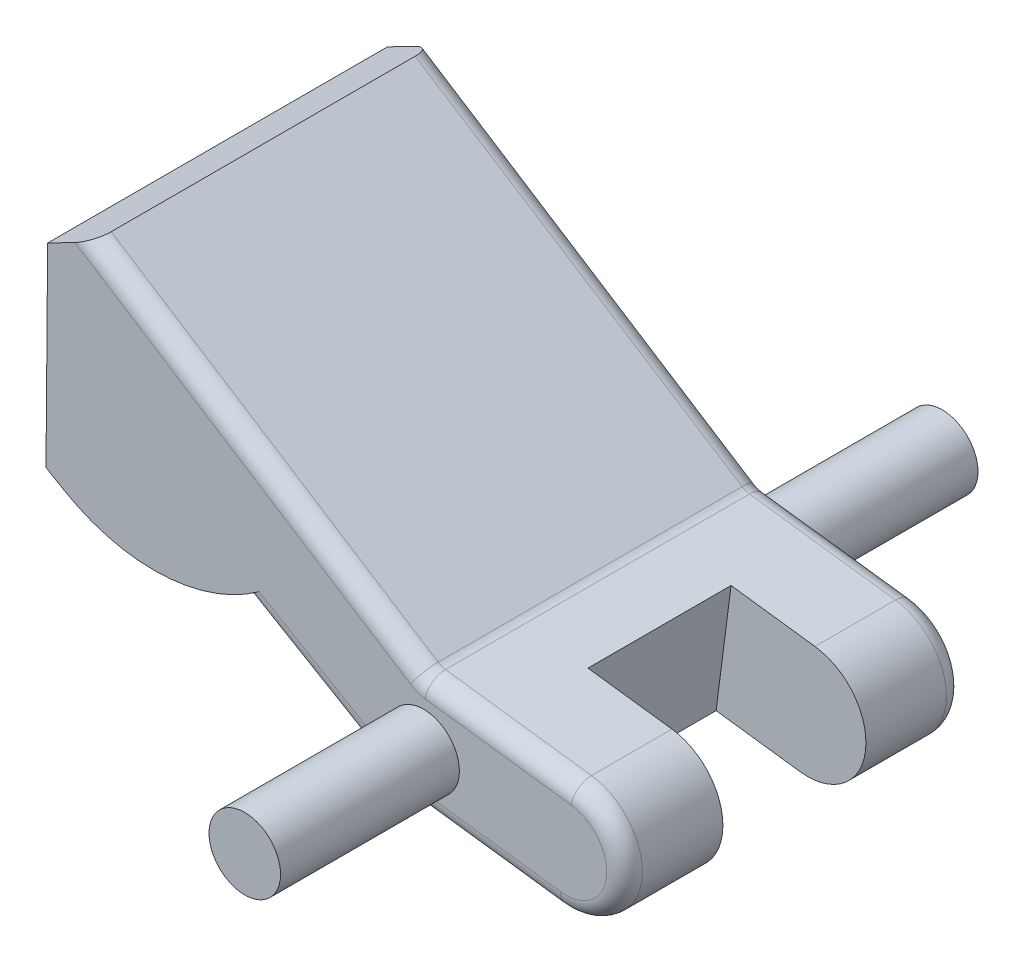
ISO-10303-21;
HEADER;
FILE_DESCRIPTION(('STEP AP214'),'2;1');
FILE_NAME('part.step','',(''),(''),'','','');
FILE_SCHEMA(('AUTOMOTIVE_DESIGN { 1 0 10303 214 1 1 1 1 }'));
ENDSEC;
DATA;
#1=APPLICATION_CONTEXT('core data for automotive mechanical design processes');
#2=APPLICATION_PROTOCOL_DEFINITION('international standard','automotive_design',2000,#1);
#3=PRODUCT_CONTEXT('',#1,'mechanical');
#4=PRODUCT('Part','Part','',(#3));
#5=PRODUCT_RELATED_PRODUCT_CATEGORY('part','',(#4));
#6=PRODUCT_DEFINITION_FORMATION('','',#4);
#7=PRODUCT_DEFINITION_CONTEXT('part definition',#1,'design');
#8=PRODUCT_DEFINITION('design','',#6,#7);
#9=PRODUCT_DEFINITION_SHAPE('','',#8);
#10=(LENGTH_UNIT() NAMED_UNIT(*) SI_UNIT(.MILLI.,.METRE.));
#11=(NAMED_UNIT(*) PLANE_ANGLE_UNIT() SI_UNIT($,.RADIAN.));
#12=(NAMED_UNIT(*) SI_UNIT($,.STERADIAN.) SOLID_ANGLE_UNIT());
#13=UNCERTAINTY_MEASURE_WITH_UNIT(LENGTH_MEASURE(1.E-05),#10,'distance_accuracy_value','');
#14=(GEOMETRIC_REPRESENTATION_CONTEXT(3) GLOBAL_UNCERTAINTY_ASSIGNED_CONTEXT((#13)) GLOBAL_UNIT_ASSIGNED_CONTEXT((#10,
#11,#12)) REPRESENTATION_CONTEXT('',''));
#15=CARTESIAN_POINT('',(0.,0.,0.));
#16=DIRECTION('',(0.,0.,1.));
#17=DIRECTION('',(1.,0.,0.));
#18=AXIS2_PLACEMENT_3D('',#15,#16,#17);
#19=CARTESIAN_POINT('',(7.96819424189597,-0.760739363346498,9.5));
#20=DIRECTION('',(0.,0.,-1.));
#21=DIRECTION('',(-1.,0.,0.));
#22=AXIS2_PLACEMENT_3D('',#19,#20,#21);
#23=CYLINDRICAL_SURFACE('',#22,3.26616509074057);
#24=DIRECTION('',(0.,0.,-1.));
#25=VECTOR('',#24,1.);
#26=CARTESIAN_POINT('',(8.38655404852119,2.478521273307,9.5));
#27=LINE('',#26,#25);
#28=CARTESIAN_POINT('',(8.38655404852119,2.478521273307,-4.));
#29=VERTEX_POINT('',#28);
#30=CARTESIAN_POINT('',(8.38655404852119,2.478521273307,-8.5));
#31=VERTEX_POINT('',#30);
#32=EDGE_CURVE('E294',#29,#31,#27,.T.);
#33=ORIENTED_EDGE('',*,*,#32,.F.);
#34=CARTESIAN_POINT('',(7.96819424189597,-0.760739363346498,-4.));
#35=DIRECTION('',(0.,0.,-1.));
#36=DIRECTION('',(-1.,0.,0.));
#37=AXIS2_PLACEMENT_3D('',#34,#35,#36);
#38=CIRCLE('',#37,3.26616509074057);
#39=CARTESIAN_POINT('',(7.54983443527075,-4.,-4.));
#40=VERTEX_POINT('',#39);
#41=EDGE_CURVE('E557',#29,#40,#38,.T.);
#42=ORIENTED_EDGE('',*,*,#41,.T.);
#43=DIRECTION('',(0.,0.,-1.));
#44=VECTOR('',#43,1.);
#45=CARTESIAN_POINT('',(7.54983443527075,-4.,9.5));
#46=LINE('',#45,#44);
#47=CARTESIAN_POINT('',(7.54983443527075,-4.,-8.5));
#48=VERTEX_POINT('',#47);
#49=EDGE_CURVE('E301',#40,#48,#46,.T.);
#50=ORIENTED_EDGE('',*,*,#49,.T.);
#51=CARTESIAN_POINT('',(7.96819424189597,-0.760739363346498,-8.5));
#52=DIRECTION('',(0.,0.,-1.));
#53=DIRECTION('',(-1.,0.,0.));
#54=AXIS2_PLACEMENT_3D('',#51,#52,#53);
#55=CIRCLE('',#54,3.26616509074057);
#56=EDGE_CURVE('E384',#48,#31,#55,.F.);
#57=ORIENTED_EDGE('',*,*,#56,.T.);
#58=EDGE_LOOP('',(#33,#42,#50,#57));
#59=FACE_BOUND('',#58,.T.);
#60=ADVANCED_FACE('F35',(#59),#23,.T.);
#61=CARTESIAN_POINT('',(-12.6758758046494,-1.82268279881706,9.5));
#62=DIRECTION('',(0.507196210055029,0.861830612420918,0.));
#63=DIRECTION('',(-0.861830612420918,0.507196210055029,0.));
#64=AXIS2_PLACEMENT_3D('',#61,#62,#63);
#65=PLANE('',#64);
#66=DIRECTION('',(0.861830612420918,-0.507196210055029,0.));
#67=VECTOR('',#66,1.);
#68=CARTESIAN_POINT('',(-27.1720806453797,6.70848336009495,5.));
#69=LINE('',#68,#67);
#70=CARTESIAN_POINT('',(-21.1154168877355,3.14407423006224,5.));
#71=VERTEX_POINT('',#70);
#72=CARTESIAN_POINT('',(-20.1395478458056,2.56976522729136,5.));
#73=VERTEX_POINT('',#72);
#74=EDGE_CURVE('E255',#71,#73,#69,.T.);
#75=ORIENTED_EDGE('',*,*,#74,.T.);
#76=DIRECTION('',(0.,0.,-1.));
#77=VECTOR('',#76,1.);
#78=CARTESIAN_POINT('',(-20.1395478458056,2.56976522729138,9.5));
#79=LINE('',#78,#77);
#80=CARTESIAN_POINT('',(-20.1395478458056,2.56976522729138,9.5));
#81=VERTEX_POINT('',#80);
#82=EDGE_CURVE('E327',#73,#81,#79,.F.);
#83=ORIENTED_EDGE('',*,*,#82,.T.);
#84=DIRECTION('',(0.861830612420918,-0.507196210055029,0.));
#85=VECTOR('',#84,1.);
#86=CARTESIAN_POINT('',(-12.6758758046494,-1.82268279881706,9.5));
#87=LINE('',#86,#85);
#88=CARTESIAN_POINT('',(-21.1154168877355,3.14407423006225,9.5));
#89=VERTEX_POINT('',#88);
#90=EDGE_CURVE('E290',#89,#81,#87,.T.);
#91=ORIENTED_EDGE('',*,*,#90,.F.);
#92=DIRECTION('',(0.,0.,-1.));
#93=VECTOR('',#92,1.);
#94=CARTESIAN_POINT('',(-21.1154168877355,3.14407423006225,9.5));
#95=LINE('',#94,#93);
#96=EDGE_CURVE('E315',#89,#71,#95,.T.);
#97=ORIENTED_EDGE('',*,*,#96,.T.);
#98=EDGE_LOOP('',(#75,#83,#91,#97));
#99=FACE_BOUND('',#98,.T.);
#100=ADVANCED_FACE('F444',(#99),#65,.F.);
#101=CARTESIAN_POINT('',(0.,3.56166879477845,9.5));
#102=DIRECTION('',(-0.128088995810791,-0.99176267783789,0.));
#103=DIRECTION('',(0.99176267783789,-0.128088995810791,0.));
#104=AXIS2_PLACEMENT_3D('',#101,#102,#103);
#105=PLANE('',#104);
#106=DIRECTION('',(0.,0.,1.));
#107=VECTOR('',#106,1.);
#108=CARTESIAN_POINT('',(3.69171326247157,3.08487343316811,4.));
#109=LINE('',#108,#107);
#110=CARTESIAN_POINT('',(3.69171326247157,3.08487343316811,-4.));
#111=VERTEX_POINT('',#110);
#112=CARTESIAN_POINT('',(3.69171326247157,3.08487343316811,4.));
#113=VERTEX_POINT('',#112);
#114=EDGE_CURVE('E229',#111,#113,#109,.T.);
#115=ORIENTED_EDGE('',*,*,#114,.F.);
#116=DIRECTION('',(-0.99176267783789,0.128088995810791,0.));
#117=VECTOR('',#116,1.);
#118=CARTESIAN_POINT('',(3.69171326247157,3.08487343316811,-4.));
#119=LINE('',#118,#117);
#120=EDGE_CURVE('E225',#29,#111,#119,.T.);
#121=ORIENTED_EDGE('',*,*,#120,.F.);
#122=ORIENTED_EDGE('',*,*,#32,.T.);
#123=DIRECTION('',(-0.99176267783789,0.128088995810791,0.));
#124=VECTOR('',#123,1.);
#125=CARTESIAN_POINT('',(0.,3.56166879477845,-8.5));
#126=LINE('',#125,#124);
#127=CARTESIAN_POINT('',(0.222201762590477,3.53297079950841,-8.5));
#128=VERTEX_POINT('',#127);
#129=EDGE_CURVE('E391',#31,#128,#126,.T.);
#130=ORIENTED_EDGE('',*,*,#129,.T.);
#131=DIRECTION('',(0.,0.,-1.));
#132=VECTOR('',#131,1.);
#133=CARTESIAN_POINT('',(0.222201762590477,3.53297079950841,9.5));
#134=LINE('',#133,#132);
#135=CARTESIAN_POINT('',(0.222201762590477,3.53297079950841,8.5));
#136=VERTEX_POINT('',#135);
#137=EDGE_CURVE('E389',#128,#136,#134,.F.);
#138=ORIENTED_EDGE('',*,*,#137,.T.);
#139=DIRECTION('',(-0.99176267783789,0.128088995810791,0.));
#140=VECTOR('',#139,1.);
#141=CARTESIAN_POINT('',(0.,3.56166879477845,8.5));
#142=LINE('',#141,#140);
#143=CARTESIAN_POINT('',(8.38655404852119,2.478521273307,8.5));
#144=VERTEX_POINT('',#143);
#145=EDGE_CURVE('E393',#136,#144,#142,.F.);
#146=ORIENTED_EDGE('',*,*,#145,.T.);
#147=CARTESIAN_POINT('',(8.38655404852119,2.478521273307,4.));
#148=VERTEX_POINT('',#147);
#149=EDGE_CURVE('E238',#144,#148,#27,.T.);
#150=ORIENTED_EDGE('',*,*,#149,.T.);
#151=DIRECTION('',(0.99176267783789,-0.128088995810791,0.));
#152=VECTOR('',#151,1.);
#153=CARTESIAN_POINT('',(3.69171326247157,3.08487343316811,4.));
#154=LINE('',#153,#152);
#155=EDGE_CURVE('E218',#113,#148,#154,.T.);
#156=ORIENTED_EDGE('',*,*,#155,.F.);
#157=EDGE_LOOP('',(#115,#121,#122,#130,#138,#146,#150,#156));
#158=FACE_BOUND('',#157,.T.);
#159=ADVANCED_FACE('F236',(#158),#105,.F.);
#160=CARTESIAN_POINT('',(0.,3.56166879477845,9.5));
#161=DIRECTION('',(-0.539006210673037,-0.842301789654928,0.));
#162=DIRECTION('',(0.842301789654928,-0.539006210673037,0.));
#163=AXIS2_PLACEMENT_3D('',#160,#161,#162);
#164=PLANE('',#163);
#165=DIRECTION('',(-0.842301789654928,0.539006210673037,0.));
#166=VECTOR('',#165,1.);
#167=CARTESIAN_POINT('',(-21.,17.,-8.5));
#168=LINE('',#167,#166);
#169=CARTESIAN_POINT('',(-0.188715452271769,3.68243168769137,-8.5));
#170=VERTEX_POINT('',#169);
#171=CARTESIAN_POINT('',(-18.4730946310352,15.3829813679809,-8.5));
#172=VERTEX_POINT('',#171);
#173=EDGE_CURVE('E395',#170,#172,#168,.T.);
#174=ORIENTED_EDGE('',*,*,#173,.T.);
#175=DIRECTION('',(0.,0.,1.));
#176=VECTOR('',#175,1.);
#177=CARTESIAN_POINT('',(-18.4730946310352,15.3829813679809,9.5));
#178=LINE('',#177,#176);
#179=CARTESIAN_POINT('',(-18.4730946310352,15.3829813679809,8.5));
#180=VERTEX_POINT('',#179);
#181=EDGE_CURVE('E58',#172,#180,#178,.T.);
#182=ORIENTED_EDGE('',*,*,#181,.T.);
#183=DIRECTION('',(-0.842301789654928,0.539006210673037,0.));
#184=VECTOR('',#183,1.);
#185=CARTESIAN_POINT('',(0.,3.56166879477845,8.5));
#186=LINE('',#185,#184);
#187=CARTESIAN_POINT('',(-0.188715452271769,3.68243168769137,8.5));
#188=VERTEX_POINT('',#187);
#189=EDGE_CURVE('E399',#180,#188,#186,.F.);
#190=ORIENTED_EDGE('',*,*,#189,.T.);
#191=DIRECTION('',(0.,0.,-1.));
#192=VECTOR('',#191,1.);
#193=CARTESIAN_POINT('',(-0.188715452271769,3.68243168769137,-9.5));
#194=LINE('',#193,#192);
#195=EDGE_CURVE('E397',#188,#170,#194,.T.);
#196=ORIENTED_EDGE('',*,*,#195,.T.);
#197=EDGE_LOOP('',(#174,#182,#190,#196));
#198=FACE_BOUND('',#197,.T.);
#199=ADVANCED_FACE('F577',(#198),#164,.F.);
#200=CARTESIAN_POINT('',(-21.1154168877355,3.14407423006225,9.5));
#201=DIRECTION('',(0.99996530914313,-0.00832949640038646,0.));
#202=DIRECTION('',(0.00832949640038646,0.99996530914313,0.));
#203=AXIS2_PLACEMENT_3D('',#200,#201,#202);
#204=PLANE('',#203);
#205=DIRECTION('',(-0.00832949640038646,-0.99996530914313,0.));
#206=VECTOR('',#205,1.);
#207=CARTESIAN_POINT('',(-21.1154168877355,3.14407423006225,9.5));
#208=LINE('',#207,#206);
#209=CARTESIAN_POINT('',(-21.0244781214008,14.0613742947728,9.5));
#210=VERTEX_POINT('',#209);
#211=EDGE_CURVE('E288',#210,#89,#208,.T.);
#212=ORIENTED_EDGE('',*,*,#211,.F.);
#213=DIRECTION('',(0.,0.,-1.));
#214=VECTOR('',#213,1.);
#215=CARTESIAN_POINT('',(-21.0244781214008,14.0613742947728,9.5));
#216=LINE('',#215,#214);
#217=CARTESIAN_POINT('',(-21.0244781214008,14.0613742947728,-9.5));
#218=VERTEX_POINT('',#217);
#219=EDGE_CURVE('E559',#210,#218,#216,.T.);
#220=ORIENTED_EDGE('',*,*,#219,.T.);
#221=DIRECTION('',(-0.00832949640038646,-0.99996530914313,0.));
#222=VECTOR('',#221,1.);
#223=CARTESIAN_POINT('',(-21.1154168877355,3.14407423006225,-9.5));
#224=LINE('',#223,#222);
#225=CARTESIAN_POINT('',(-21.1154168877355,3.14407423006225,-9.5));
#226=VERTEX_POINT('',#225);
#227=EDGE_CURVE('E295',#218,#226,#224,.T.);
#228=ORIENTED_EDGE('',*,*,#227,.T.);
#229=CARTESIAN_POINT('',(-21.1154168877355,3.14407423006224,-5.));
#230=VERTEX_POINT('',#229);
#231=EDGE_CURVE('E314',#230,#226,#95,.T.);
#232=ORIENTED_EDGE('',*,*,#231,.F.);
#233=DIRECTION('',(0.00832949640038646,0.99996530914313,0.));
#234=VECTOR('',#233,1.);
#235=CARTESIAN_POINT('',(-21.1154168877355,3.14407423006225,-5.));
#236=LINE('',#235,#234);
#237=CARTESIAN_POINT('',(-21.0673265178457,8.91737663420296,-5.));
#238=VERTEX_POINT('',#237);
#239=EDGE_CURVE('E259',#230,#238,#236,.T.);
#240=ORIENTED_EDGE('',*,*,#239,.T.);
#241=DIRECTION('',(0.,0.,1.));
#242=VECTOR('',#241,1.);
#243=CARTESIAN_POINT('',(-21.0673265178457,8.91737663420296,9.5));
#244=LINE('',#243,#242);
#245=CARTESIAN_POINT('',(-21.0673265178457,8.91737663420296,5.));
#246=VERTEX_POINT('',#245);
#247=EDGE_CURVE('E270',#238,#246,#244,.T.);
#248=ORIENTED_EDGE('',*,*,#247,.T.);
#249=DIRECTION('',(-0.00832949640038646,-0.99996530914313,0.));
#250=VECTOR('',#249,1.);
#251=CARTESIAN_POINT('',(-21.1154168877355,3.14407423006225,5.));
#252=LINE('',#251,#250);
#253=EDGE_CURVE('E273',#246,#71,#252,.T.);
#254=ORIENTED_EDGE('',*,*,#253,.T.);
#255=ORIENTED_EDGE('',*,*,#96,.F.);
#256=EDGE_LOOP('',(#212,#220,#228,#232,#240,#248,#254,#255));
#257=FACE_BOUND('',#256,.T.);
#258=ADVANCED_FACE('F517',(#257),#204,.F.);
#259=DIRECTION('',(0.861830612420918,-0.507196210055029,0.));
#260=VECTOR('',#259,1.);
#261=CARTESIAN_POINT('',(-12.6758758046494,-1.82268279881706,-9.5));
#262=LINE('',#261,#260);
#263=CARTESIAN_POINT('',(-20.1395478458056,2.56976522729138,-9.5));
#264=VERTEX_POINT('',#263);
#265=EDGE_CURVE('E291',#226,#264,#262,.T.);
#266=ORIENTED_EDGE('',*,*,#265,.T.);
#267=DIRECTION('',(0.,0.,-1.));
#268=VECTOR('',#267,1.);
#269=CARTESIAN_POINT('',(-20.1395478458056,2.56976522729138,9.5));
#270=LINE('',#269,#268);
#271=CARTESIAN_POINT('',(-20.1395478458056,2.56976522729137,-5.));
#272=VERTEX_POINT('',#271);
#273=EDGE_CURVE('E321',#264,#272,#270,.F.);
#274=ORIENTED_EDGE('',*,*,#273,.T.);
#275=DIRECTION('',(0.861830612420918,-0.507196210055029,0.));
#276=VECTOR('',#275,1.);
#277=CARTESIAN_POINT('',(-27.1720806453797,6.70848336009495,-5.));
#278=LINE('',#277,#276);
#279=EDGE_CURVE('E263',#230,#272,#278,.T.);
#280=ORIENTED_EDGE('',*,*,#279,.F.);
#281=ORIENTED_EDGE('',*,*,#231,.T.);
#282=EDGE_LOOP('',(#266,#274,#280,#281));
#283=FACE_BOUND('',#282,.T.);
#284=ADVANCED_FACE('F453',(#283),#65,.F.);
#285=CARTESIAN_POINT('',(-1.52158863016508,-2.58549183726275,9.5));
#286=DIRECTION('',(0.507196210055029,0.861830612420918,0.));
#287=DIRECTION('',(-0.861830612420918,0.507196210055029,0.));
#288=AXIS2_PLACEMENT_3D('',#285,#286,#287);
#289=PLANE('',#288);
#290=CARTESIAN_POINT('',(-15.5435726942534,5.66659050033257,0.));
#291=DIRECTION('',(0.507196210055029,0.861830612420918,0.));
#292=DIRECTION('',(-0.861830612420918,0.507196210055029,0.));
#293=AXIS2_PLACEMENT_3D('',#290,#291,#292);
#294=CIRCLE('',#293,4.302);
#295=CARTESIAN_POINT('',(-19.2511679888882,7.8485485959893,0.));
#296=VERTEX_POINT('',#295);
#297=EDGE_CURVE('E334',#296,#296,#294,.T.);
#298=ORIENTED_EDGE('',*,*,#297,.T.);
#299=EDGE_LOOP('',(#298));
#300=FACE_BOUND('',#299,.T.);
#301=DIRECTION('',(0.,0.,-1.));
#302=VECTOR('',#301,1.);
#303=CARTESIAN_POINT('',(-1.52158863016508,-2.58549183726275,9.5));
#304=LINE('',#303,#302);
#305=CARTESIAN_POINT('',(-1.52158863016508,-2.58549183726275,8.5));
#306=VERTEX_POINT('',#305);
#307=CARTESIAN_POINT('',(-1.52158863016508,-2.58549183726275,-8.5));
#308=VERTEX_POINT('',#307);
#309=EDGE_CURVE('E308',#306,#308,#304,.T.);
#310=ORIENTED_EDGE('',*,*,#309,.F.);
#311=DIRECTION('',(0.861830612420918,-0.507196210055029,0.));
#312=VECTOR('',#311,1.);
#313=CARTESIAN_POINT('',(-1.52158863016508,-2.58549183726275,8.5));
#314=LINE('',#313,#312);
#315=CARTESIAN_POINT('',(-10.1398947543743,2.48647026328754,8.5));
#316=VERTEX_POINT('',#315);
#317=EDGE_CURVE('E359',#306,#316,#314,.F.);
#318=ORIENTED_EDGE('',*,*,#317,.T.);
#319=DIRECTION('',(0.,0.,-1.));
#320=VECTOR('',#319,1.);
#321=CARTESIAN_POINT('',(-10.1398947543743,2.48647026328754,9.5));
#322=LINE('',#321,#320);
#323=CARTESIAN_POINT('',(-10.1398947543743,2.48647026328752,5.));
#324=VERTEX_POINT('',#323);
#325=EDGE_CURVE('E312',#316,#324,#322,.T.);
#326=ORIENTED_EDGE('',*,*,#325,.T.);
#327=DIRECTION('',(0.861830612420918,-0.507196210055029,0.));
#328=VECTOR('',#327,1.);
#329=CARTESIAN_POINT('',(-24.6360995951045,11.0176364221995,5.));
#330=LINE('',#329,#328);
#331=EDGE_CURVE('E256',#246,#324,#330,.T.);
#332=ORIENTED_EDGE('',*,*,#331,.F.);
#333=ORIENTED_EDGE('',*,*,#247,.F.);
#334=DIRECTION('',(0.861830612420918,-0.507196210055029,0.));
#335=VECTOR('',#334,1.);
#336=CARTESIAN_POINT('',(-24.6360995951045,11.0176364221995,-5.));
#337=LINE('',#336,#335);
#338=CARTESIAN_POINT('',(-10.1398947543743,2.48647026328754,-5.));
#339=VERTEX_POINT('',#338);
#340=EDGE_CURVE('E260',#238,#339,#337,.T.);
#341=ORIENTED_EDGE('',*,*,#340,.T.);
#342=CARTESIAN_POINT('',(-10.1398947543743,2.48647026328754,-8.5));
#343=VERTEX_POINT('',#342);
#344=EDGE_CURVE('E311',#339,#343,#322,.T.);
#345=ORIENTED_EDGE('',*,*,#344,.T.);
#346=DIRECTION('',(0.861830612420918,-0.507196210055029,0.));
#347=VECTOR('',#346,1.);
#348=CARTESIAN_POINT('',(-1.52158863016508,-2.58549183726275,-8.5));
#349=LINE('',#348,#347);
#350=EDGE_CURVE('E357',#343,#308,#349,.T.);
#351=ORIENTED_EDGE('',*,*,#350,.T.);
#352=EDGE_LOOP('',(#310,#318,#326,#332,#333,#341,#345,#351));
#353=FACE_BOUND('',#352,.T.);
#354=ADVANCED_FACE('F502',(#300,#353),#289,.F.);
#355=CARTESIAN_POINT('',(0.,0.,9.5));
#356=DIRECTION('',(0.,0.,-1.));
#357=DIRECTION('',(-1.,0.,0.));
#358=AXIS2_PLACEMENT_3D('',#355,#356,#357);
#359=CYLINDRICAL_SURFACE('',#358,3.);
#360=DIRECTION('',(0.,0.,-1.));
#361=VECTOR('',#360,1.);
#362=CARTESIAN_POINT('',(-0.384266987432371,-2.97528803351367,9.5));
#363=LINE('',#362,#361);
#364=CARTESIAN_POINT('',(-0.384266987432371,-2.97528803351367,8.5));
#365=VERTEX_POINT('',#364);
#366=CARTESIAN_POINT('',(-0.384266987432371,-2.97528803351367,-8.5));
#367=VERTEX_POINT('',#366);
#368=EDGE_CURVE('E305',#365,#367,#363,.T.);
#369=ORIENTED_EDGE('',*,*,#368,.F.);
#370=CARTESIAN_POINT('',(0.,0.,8.5));
#371=DIRECTION('',(0.,0.,-1.));
#372=DIRECTION('',(-1.,0.,0.));
#373=AXIS2_PLACEMENT_3D('',#370,#371,#372);
#374=CIRCLE('',#373,3.);
#375=EDGE_CURVE('E377',#365,#306,#374,.T.);
#376=ORIENTED_EDGE('',*,*,#375,.T.);
#377=ORIENTED_EDGE('',*,*,#309,.T.);
#378=CARTESIAN_POINT('',(0.,0.,-8.5));
#379=DIRECTION('',(0.,0.,-1.));
#380=DIRECTION('',(-1.,0.,0.));
#381=AXIS2_PLACEMENT_3D('',#378,#379,#380);
#382=CIRCLE('',#381,3.);
#383=EDGE_CURVE('E375',#308,#367,#382,.F.);
#384=ORIENTED_EDGE('',*,*,#383,.T.);
#385=EDGE_LOOP('',(#369,#376,#377,#384));
#386=FACE_BOUND('',#385,.T.);
#387=ADVANCED_FACE('F468',(#386),#359,.T.);
#388=CARTESIAN_POINT('',(-0.384266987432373,-2.97528803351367,9.5));
#389=DIRECTION('',(0.128088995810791,0.99176267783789,0.));
#390=DIRECTION('',(-0.99176267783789,0.128088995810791,0.));
#391=AXIS2_PLACEMENT_3D('',#388,#389,#390);
#392=PLANE('',#391);
#393=ORIENTED_EDGE('',*,*,#49,.F.);
#394=DIRECTION('',(0.99176267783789,-0.128088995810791,0.));
#395=VECTOR('',#394,1.);
#396=CARTESIAN_POINT('',(2.85499364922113,-3.39364784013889,-4.));
#397=LINE('',#396,#395);
#398=CARTESIAN_POINT('',(2.85499364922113,-3.39364784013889,-4.));
#399=VERTEX_POINT('',#398);
#400=EDGE_CURVE('E243',#399,#40,#397,.T.);
#401=ORIENTED_EDGE('',*,*,#400,.F.);
#402=DIRECTION('',(0.,0.,-1.));
#403=VECTOR('',#402,1.);
#404=CARTESIAN_POINT('',(2.85499364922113,-3.39364784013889,4.));
#405=LINE('',#404,#403);
#406=CARTESIAN_POINT('',(2.85499364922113,-3.39364784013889,4.));
#407=VERTEX_POINT('',#406);
#408=EDGE_CURVE('E247',#407,#399,#405,.T.);
#409=ORIENTED_EDGE('',*,*,#408,.F.);
#410=DIRECTION('',(-0.99176267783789,0.128088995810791,0.));
#411=VECTOR('',#410,1.);
#412=CARTESIAN_POINT('',(2.85499364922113,-3.39364784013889,4.));
#413=LINE('',#412,#411);
#414=CARTESIAN_POINT('',(7.54983443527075,-4.,4.));
#415=VERTEX_POINT('',#414);
#416=EDGE_CURVE('E221',#415,#407,#413,.T.);
#417=ORIENTED_EDGE('',*,*,#416,.F.);
#418=CARTESIAN_POINT('',(7.54983443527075,-4.,8.5));
#419=VERTEX_POINT('',#418);
#420=EDGE_CURVE('E302',#419,#415,#46,.T.);
#421=ORIENTED_EDGE('',*,*,#420,.F.);
#422=DIRECTION('',(0.99176267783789,-0.128088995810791,0.));
#423=VECTOR('',#422,1.);
#424=CARTESIAN_POINT('',(-0.384266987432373,-2.97528803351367,8.5));
#425=LINE('',#424,#423);
#426=EDGE_CURVE('E382',#419,#365,#425,.F.);
#427=ORIENTED_EDGE('',*,*,#426,.T.);
#428=ORIENTED_EDGE('',*,*,#368,.T.);
#429=DIRECTION('',(0.99176267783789,-0.128088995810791,0.));
#430=VECTOR('',#429,1.);
#431=CARTESIAN_POINT('',(7.54983443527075,-4.,-8.5));
#432=LINE('',#431,#430);
#433=EDGE_CURVE('E379',#367,#48,#432,.T.);
#434=ORIENTED_EDGE('',*,*,#433,.T.);
#435=EDGE_LOOP('',(#393,#401,#409,#417,#421,#427,#428,#434));
#436=FACE_BOUND('',#435,.T.);
#437=ADVANCED_FACE('F459',(#436),#392,.F.);
#438=ORIENTED_EDGE('',*,*,#420,.T.);
#439=CARTESIAN_POINT('',(7.96819424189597,-0.760739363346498,4.));
#440=DIRECTION('',(0.,0.,1.));
#441=DIRECTION('',(1.,0.,0.));
#442=AXIS2_PLACEMENT_3D('',#439,#440,#441);
#443=CIRCLE('',#442,3.26616509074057);
#444=EDGE_CURVE('E471',#415,#148,#443,.T.);
#445=ORIENTED_EDGE('',*,*,#444,.T.);
#446=ORIENTED_EDGE('',*,*,#149,.F.);
#447=CARTESIAN_POINT('',(7.96819424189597,-0.760739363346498,8.5));
#448=DIRECTION('',(0.,0.,-1.));
#449=DIRECTION('',(-1.,0.,0.));
#450=AXIS2_PLACEMENT_3D('',#447,#448,#449);
#451=CIRCLE('',#450,3.26616509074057);
#452=EDGE_CURVE('E387',#144,#419,#451,.T.);
#453=ORIENTED_EDGE('',*,*,#452,.T.);
#454=EDGE_LOOP('',(#438,#445,#446,#453));
#455=FACE_BOUND('',#454,.T.);
#456=ADVANCED_FACE('F447',(#455),#23,.T.);
#457=CARTESIAN_POINT('',(7.96819424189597,-0.760739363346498,9.5));
#458=DIRECTION('',(0.,0.,-1.));
#459=DIRECTION('',(-1.,0.,0.));
#460=AXIS2_PLACEMENT_3D('',#457,#458,#459);
#461=PLANE('',#460);
#462=DIRECTION('',(-0.842301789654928,0.539006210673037,0.));
#463=VECTOR('',#462,1.);
#464=CARTESIAN_POINT('',(7.0766057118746,-2.15401943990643,9.5));
#465=LINE('',#464,#463);
#466=CARTESIAN_POINT('',(-0.727721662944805,2.84012989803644,9.5));
#467=VERTEX_POINT('',#466);
#468=CARTESIAN_POINT('',(-19.4984040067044,14.8518749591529,9.5));
#469=VERTEX_POINT('',#468);
#470=EDGE_CURVE('E343',#467,#469,#465,.T.);
#471=ORIENTED_EDGE('',*,*,#470,.T.);
#472=DIRECTION('',(0.887943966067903,0.459951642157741,0.));
#473=VECTOR('',#472,1.);
#474=CARTESIAN_POINT('',(-21.0244781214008,14.0613742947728,9.5));
#475=LINE('',#474,#473);
#476=EDGE_CURVE('E11',#469,#210,#475,.F.);
#477=ORIENTED_EDGE('',*,*,#476,.T.);
#478=ORIENTED_EDGE('',*,*,#211,.T.);
#479=ORIENTED_EDGE('',*,*,#90,.T.);
#480=CARTESIAN_POINT('',(-15.0675857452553,11.1880713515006,9.5));
#481=DIRECTION('',(0.,0.,-1.));
#482=DIRECTION('',(-1.,0.,0.));
#483=AXIS2_PLACEMENT_3D('',#480,#481,#482);
#484=CIRCLE('',#483,10.);
#485=CARTESIAN_POINT('',(-9.19756255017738,3.0922188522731,9.5));
#486=VERTEX_POINT('',#485);
#487=EDGE_CURVE('E329',#81,#486,#484,.F.);
#488=ORIENTED_EDGE('',*,*,#487,.T.);
#489=DIRECTION('',(0.861830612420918,-0.507196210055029,0.));
#490=VECTOR('',#489,1.);
#491=CARTESIAN_POINT('',(5.23653210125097,-5.40239481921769,9.5));
#492=LINE('',#491,#490);
#493=CARTESIAN_POINT('',(-1.01439242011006,-1.72366122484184,9.5));
#494=VERTEX_POINT('',#493);
#495=EDGE_CURVE('E354',#486,#494,#492,.T.);
#496=ORIENTED_EDGE('',*,*,#495,.T.);
#497=CARTESIAN_POINT('',(0.,0.,9.5));
#498=DIRECTION('',(0.,0.,-1.));
#499=DIRECTION('',(-1.,0.,0.));
#500=AXIS2_PLACEMENT_3D('',#497,#498,#499);
#501=CIRCLE('',#500,2.);
#502=CARTESIAN_POINT('',(-0.256177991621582,-1.98352535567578,9.5));
#503=VERTEX_POINT('',#502);
#504=EDGE_CURVE('E287',#503,#494,#501,.F.);
#505=ORIENTED_EDGE('',*,*,#504,.F.);
#506=DIRECTION('',(0.99176267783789,-0.128088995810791,0.));
#507=VECTOR('',#506,1.);
#508=CARTESIAN_POINT('',(7.67792343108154,-3.00823732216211,9.5));
#509=LINE('',#508,#507);
#510=CARTESIAN_POINT('',(7.67792343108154,-3.00823732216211,9.5));
#511=VERTEX_POINT('',#510);
#512=EDGE_CURVE('E352',#503,#511,#509,.T.);
#513=ORIENTED_EDGE('',*,*,#512,.T.);
#514=CARTESIAN_POINT('',(7.96819424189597,-0.760739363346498,9.5));
#515=DIRECTION('',(0.,0.,-1.));
#516=DIRECTION('',(-1.,0.,0.));
#517=AXIS2_PLACEMENT_3D('',#514,#515,#516);
#518=CIRCLE('',#517,2.26616509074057);
#519=CARTESIAN_POINT('',(8.2584650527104,1.48675859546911,9.5));
#520=VERTEX_POINT('',#519);
#521=EDGE_CURVE('E350',#511,#520,#518,.F.);
#522=ORIENTED_EDGE('',*,*,#521,.T.);
#523=DIRECTION('',(-0.99176267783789,0.128088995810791,0.));
#524=VECTOR('',#523,1.);
#525=CARTESIAN_POINT('',(8.2584650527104,1.48675859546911,9.5));
#526=LINE('',#525,#524);
#527=CARTESIAN_POINT('',(0.0941127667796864,2.54120812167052,9.5));
#528=VERTEX_POINT('',#527);
#529=EDGE_CURVE('E348',#520,#528,#526,.T.);
#530=ORIENTED_EDGE('',*,*,#529,.T.);
#531=CARTESIAN_POINT('',(0.350290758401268,4.5247334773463,9.5));
#532=DIRECTION('',(0.,0.,-1.));
#533=DIRECTION('',(-1.,0.,0.));
#534=AXIS2_PLACEMENT_3D('',#531,#532,#533);
#535=CIRCLE('',#534,2.);
#536=EDGE_CURVE('E345',#467,#528,#535,.F.);
#537=ORIENTED_EDGE('',*,*,#536,.F.);
#538=EDGE_LOOP('',(#471,#477,#478,#479,#488,#496,#505,#513,#522,#530,#537));
#539=FACE_BOUND('',#538,.T.);
#540=ADVANCED_FACE('F458',(#539),#461,.F.);
#541=CARTESIAN_POINT('',(7.96819424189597,-0.760739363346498,-9.5));
#542=DIRECTION('',(0.,0.,-1.));
#543=DIRECTION('',(-1.,0.,0.));
#544=AXIS2_PLACEMENT_3D('',#541,#542,#543);
#545=PLANE('',#544);
#546=ORIENTED_EDGE('',*,*,#227,.F.);
#547=DIRECTION('',(-0.887943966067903,-0.459951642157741,0.));
#548=VECTOR('',#547,1.);
#549=CARTESIAN_POINT('',(-4.21888392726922,22.7666090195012,-9.5));
#550=LINE('',#549,#548);
#551=CARTESIAN_POINT('',(-19.4984040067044,14.8518749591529,-9.5));
#552=VERTEX_POINT('',#551);
#553=EDGE_CURVE('E562',#218,#552,#550,.F.);
#554=ORIENTED_EDGE('',*,*,#553,.T.);
#555=DIRECTION('',(-0.842301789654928,0.539006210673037,0.));
#556=VECTOR('',#555,1.);
#557=CARTESIAN_POINT('',(-0.539006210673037,2.71936700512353,-9.5));
#558=LINE('',#557,#556);
#559=CARTESIAN_POINT('',(-0.727721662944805,2.84012989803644,-9.5));
#560=VERTEX_POINT('',#559);
#561=EDGE_CURVE('E364',#552,#560,#558,.F.);
#562=ORIENTED_EDGE('',*,*,#561,.T.);
#563=CARTESIAN_POINT('',(0.350290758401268,4.5247334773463,-9.5));
#564=DIRECTION('',(0.,0.,-1.));
#565=DIRECTION('',(-1.,0.,0.));
#566=AXIS2_PLACEMENT_3D('',#563,#564,#565);
#567=CIRCLE('',#566,2.);
#568=CARTESIAN_POINT('',(0.0941127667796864,2.54120812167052,-9.5));
#569=VERTEX_POINT('',#568);
#570=EDGE_CURVE('E361',#569,#560,#567,.T.);
#571=ORIENTED_EDGE('',*,*,#570,.F.);
#572=DIRECTION('',(-0.99176267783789,0.128088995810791,0.));
#573=VECTOR('',#572,1.);
#574=CARTESIAN_POINT('',(8.2584650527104,1.48675859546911,-9.5));
#575=LINE('',#574,#573);
#576=CARTESIAN_POINT('',(8.2584650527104,1.48675859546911,-9.5));
#577=VERTEX_POINT('',#576);
#578=EDGE_CURVE('E366',#569,#577,#575,.F.);
#579=ORIENTED_EDGE('',*,*,#578,.T.);
#580=CARTESIAN_POINT('',(7.96819424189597,-0.760739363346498,-9.5));
#581=DIRECTION('',(0.,0.,-1.));
#582=DIRECTION('',(-1.,0.,0.));
#583=AXIS2_PLACEMENT_3D('',#580,#581,#582);
#584=CIRCLE('',#583,2.26616509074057);
#585=CARTESIAN_POINT('',(7.67792343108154,-3.00823732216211,-9.5));
#586=VERTEX_POINT('',#585);
#587=EDGE_CURVE('E368',#577,#586,#584,.T.);
#588=ORIENTED_EDGE('',*,*,#587,.T.);
#589=DIRECTION('',(0.99176267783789,-0.128088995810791,0.));
#590=VECTOR('',#589,1.);
#591=CARTESIAN_POINT('',(-0.256177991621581,-1.98352535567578,-9.5));
#592=LINE('',#591,#590);
#593=CARTESIAN_POINT('',(-0.256177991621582,-1.98352535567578,-9.5));
#594=VERTEX_POINT('',#593);
#595=EDGE_CURVE('E370',#586,#594,#592,.F.);
#596=ORIENTED_EDGE('',*,*,#595,.T.);
#597=CARTESIAN_POINT('',(0.,0.,-9.5));
#598=DIRECTION('',(0.,0.,-1.));
#599=DIRECTION('',(-1.,0.,0.));
#600=AXIS2_PLACEMENT_3D('',#597,#598,#599);
#601=CIRCLE('',#600,2.);
#602=CARTESIAN_POINT('',(-1.01439242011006,-1.72366122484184,-9.5));
#603=VERTEX_POINT('',#602);
#604=EDGE_CURVE('E280',#594,#603,#601,.F.);
#605=ORIENTED_EDGE('',*,*,#604,.T.);
#606=DIRECTION('',(0.861830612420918,-0.507196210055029,0.));
#607=VECTOR('',#606,1.);
#608=CARTESIAN_POINT('',(-9.63269854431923,3.34830087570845,-9.5));
#609=LINE('',#608,#607);
#610=CARTESIAN_POINT('',(-9.19756255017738,3.0922188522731,-9.5));
#611=VERTEX_POINT('',#610);
#612=EDGE_CURVE('E372',#603,#611,#609,.F.);
#613=ORIENTED_EDGE('',*,*,#612,.T.);
#614=CARTESIAN_POINT('',(-15.0675857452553,11.1880713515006,-9.5));
#615=DIRECTION('',(0.,0.,-1.));
#616=DIRECTION('',(-1.,0.,0.));
#617=AXIS2_PLACEMENT_3D('',#614,#615,#616);
#618=CIRCLE('',#617,10.);
#619=EDGE_CURVE('E286',#611,#264,#618,.T.);
#620=ORIENTED_EDGE('',*,*,#619,.T.);
#621=ORIENTED_EDGE('',*,*,#265,.F.);
#622=EDGE_LOOP('',(#546,#554,#562,#571,#579,#588,#596,#605,#613,#620,#621));
#623=FACE_BOUND('',#622,.T.);
#624=ADVANCED_FACE('F465',(#623),#545,.T.);
#625=CARTESIAN_POINT('',(0.,0.,-19.5));
#626=DIRECTION('',(0.,0.,1.));
#627=DIRECTION('',(1.,0.,0.));
#628=AXIS2_PLACEMENT_3D('',#625,#626,#627);
#629=PLANE('',#628);
#630=CARTESIAN_POINT('',(0.,0.,-19.5));
#631=DIRECTION('',(0.,0.,1.));
#632=DIRECTION('',(1.,0.,0.));
#633=AXIS2_PLACEMENT_3D('',#630,#631,#632);
#634=CIRCLE('',#633,2.);
#635=CARTESIAN_POINT('',(2.,0.,-19.5));
#636=VERTEX_POINT('',#635);
#637=EDGE_CURVE('E276',#636,#636,#634,.T.);
#638=ORIENTED_EDGE('',*,*,#637,.F.);
#639=EDGE_LOOP('',(#638));
#640=FACE_BOUND('',#639,.T.);
#641=ADVANCED_FACE('F598',(#640),#629,.F.);
#642=CARTESIAN_POINT('',(0.,0.,19.5));
#643=DIRECTION('',(0.,0.,-1.));
#644=DIRECTION('',(-1.,0.,0.));
#645=AXIS2_PLACEMENT_3D('',#642,#643,#644);
#646=CYLINDRICAL_SURFACE('',#645,2.);
#647=EDGE_CURVE('E297',#603,#594,#601,.F.);
#648=ORIENTED_EDGE('',*,*,#647,.F.);
#649=ORIENTED_EDGE('',*,*,#604,.F.);
#650=EDGE_LOOP('',(#648,#649));
#651=FACE_BOUND('',#650,.T.);
#652=ORIENTED_EDGE('',*,*,#637,.T.);
#653=EDGE_LOOP('',(#652));
#654=FACE_BOUND('',#653,.T.);
#655=ADVANCED_FACE('F588',(#651,#654),#646,.T.);
#656=CARTESIAN_POINT('',(0.,0.,19.5));
#657=DIRECTION('',(0.,0.,1.));
#658=DIRECTION('',(1.,0.,0.));
#659=AXIS2_PLACEMENT_3D('',#656,#657,#658);
#660=CIRCLE('',#659,2.);
#661=CARTESIAN_POINT('',(2.,0.,19.5));
#662=VERTEX_POINT('',#661);
#663=EDGE_CURVE('E277',#662,#662,#660,.T.);
#664=ORIENTED_EDGE('',*,*,#663,.F.);
#665=EDGE_LOOP('',(#664));
#666=FACE_BOUND('',#665,.T.);
#667=EDGE_CURVE('E283',#494,#503,#501,.F.);
#668=ORIENTED_EDGE('',*,*,#667,.T.);
#669=ORIENTED_EDGE('',*,*,#504,.T.);
#670=EDGE_LOOP('',(#668,#669));
#671=FACE_BOUND('',#670,.T.);
#672=ADVANCED_FACE('F585',(#666,#671),#646,.T.);
#673=CARTESIAN_POINT('',(0.,0.,19.5));
#674=DIRECTION('',(0.,0.,1.));
#675=DIRECTION('',(1.,0.,0.));
#676=AXIS2_PLACEMENT_3D('',#673,#674,#675);
#677=PLANE('',#676);
#678=ORIENTED_EDGE('',*,*,#663,.T.);
#679=EDGE_LOOP('',(#678));
#680=FACE_BOUND('',#679,.T.);
#681=ADVANCED_FACE('F587',(#680),#677,.T.);
#682=CARTESIAN_POINT('',(-27.1720806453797,6.70848336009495,5.));
#683=DIRECTION('',(0.,0.,1.));
#684=DIRECTION('',(1.,0.,0.));
#685=AXIS2_PLACEMENT_3D('',#682,#683,#684);
#686=PLANE('',#685);
#687=ORIENTED_EDGE('',*,*,#331,.T.);
#688=CARTESIAN_POINT('',(-15.0675857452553,11.1880713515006,5.));
#689=DIRECTION('',(0.,0.,1.));
#690=DIRECTION('',(1.,0.,0.));
#691=AXIS2_PLACEMENT_3D('',#688,#689,#690);
#692=CIRCLE('',#691,10.);
#693=EDGE_CURVE('E325',#324,#73,#692,.F.);
#694=ORIENTED_EDGE('',*,*,#693,.T.);
#695=ORIENTED_EDGE('',*,*,#74,.F.);
#696=ORIENTED_EDGE('',*,*,#253,.F.);
#697=EDGE_LOOP('',(#687,#694,#695,#696));
#698=FACE_BOUND('',#697,.T.);
#699=ADVANCED_FACE('F595',(#698),#686,.F.);
#700=CARTESIAN_POINT('',(-27.1720806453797,6.70848336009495,-5.));
#701=DIRECTION('',(0.,0.,-1.));
#702=DIRECTION('',(-1.,0.,0.));
#703=AXIS2_PLACEMENT_3D('',#700,#701,#702);
#704=PLANE('',#703);
#705=ORIENTED_EDGE('',*,*,#279,.T.);
#706=CARTESIAN_POINT('',(-15.0675857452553,11.1880713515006,-5.));
#707=DIRECTION('',(0.,0.,-1.));
#708=DIRECTION('',(-1.,0.,0.));
#709=AXIS2_PLACEMENT_3D('',#706,#707,#708);
#710=CIRCLE('',#709,10.);
#711=EDGE_CURVE('E323',#272,#339,#710,.F.);
#712=ORIENTED_EDGE('',*,*,#711,.T.);
#713=ORIENTED_EDGE('',*,*,#340,.F.);
#714=ORIENTED_EDGE('',*,*,#239,.F.);
#715=EDGE_LOOP('',(#705,#712,#713,#714));
#716=FACE_BOUND('',#715,.T.);
#717=ADVANCED_FACE('F523',(#716),#704,.F.);
#718=CARTESIAN_POINT('',(-13.7683859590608,8.68299764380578,0.));
#719=DIRECTION('',(-0.507196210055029,-0.861830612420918,0.));
#720=DIRECTION('',(0.861830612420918,-0.507196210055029,0.));
#721=AXIS2_PLACEMENT_3D('',#718,#719,#720);
#722=CYLINDRICAL_SURFACE('',#721,3.302);
#723=CARTESIAN_POINT('',(-15.0363764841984,6.52842111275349,0.));
#724=DIRECTION('',(0.507196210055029,0.861830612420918,0.));
#725=DIRECTION('',(-0.861830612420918,0.507196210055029,0.));
#726=AXIS2_PLACEMENT_3D('',#723,#724,#725);
#727=CIRCLE('',#726,3.302);
#728=CARTESIAN_POINT('',(-17.8821411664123,8.20318299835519,0.));
#729=VERTEX_POINT('',#728);
#730=EDGE_CURVE('E331',#729,#729,#727,.F.);
#731=ORIENTED_EDGE('',*,*,#730,.T.);
#732=EDGE_LOOP('',(#731));
#733=FACE_BOUND('',#732,.T.);
#734=CARTESIAN_POINT('',(-13.7683859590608,8.68299764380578,0.));
#735=DIRECTION('',(-0.507196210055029,-0.861830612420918,0.));
#736=DIRECTION('',(0.861830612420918,-0.507196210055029,0.));
#737=AXIS2_PLACEMENT_3D('',#734,#735,#736);
#738=CIRCLE('',#737,3.302);
#739=CARTESIAN_POINT('',(-10.922621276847,7.00823575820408,0.));
#740=VERTEX_POINT('',#739);
#741=EDGE_CURVE('E251',#740,#740,#738,.T.);
#742=ORIENTED_EDGE('',*,*,#741,.F.);
#743=EDGE_LOOP('',(#742));
#744=FACE_BOUND('',#743,.T.);
#745=ADVANCED_FACE('F672',(#733,#744),#722,.F.);
#746=CARTESIAN_POINT('',(-13.7683859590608,8.68299764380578,0.));
#747=DIRECTION('',(-0.507196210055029,-0.861830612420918,0.));
#748=DIRECTION('',(0.861830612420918,-0.507196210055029,0.));
#749=AXIS2_PLACEMENT_3D('',#746,#747,#748);
#750=PLANE('',#749);
#751=CARTESIAN_POINT('',(-13.7683859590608,8.68299764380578,0.));
#752=DIRECTION('',(-0.507196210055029,-0.861830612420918,0.));
#753=DIRECTION('',(0.861830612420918,-0.507196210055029,0.));
#754=AXIS2_PLACEMENT_3D('',#751,#752,#753);
#755=CIRCLE('',#754,2.413);
#756=CARTESIAN_POINT('',(-11.6887886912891,7.459133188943,0.));
#757=VERTEX_POINT('',#756);
#758=EDGE_CURVE('E248',#757,#757,#755,.T.);
#759=ORIENTED_EDGE('',*,*,#758,.F.);
#760=EDGE_LOOP('',(#759));
#761=FACE_BOUND('',#760,.T.);
#762=ORIENTED_EDGE('',*,*,#741,.T.);
#763=EDGE_LOOP('',(#762));
#764=FACE_BOUND('',#763,.T.);
#765=ADVANCED_FACE('F668',(#761,#764),#750,.T.);
#766=CARTESIAN_POINT('',(-13.7683859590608,8.68299764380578,0.));
#767=DIRECTION('',(-0.507196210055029,-0.861830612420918,0.));
#768=DIRECTION('',(0.861830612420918,-0.507196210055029,0.));
#769=AXIS2_PLACEMENT_3D('',#766,#767,#768);
#770=CYLINDRICAL_SURFACE('',#769,2.413);
#771=CARTESIAN_POINT('',(-15.0363764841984,6.52842111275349,0.));
#772=DIRECTION('',(0.507196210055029,0.861830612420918,0.));
#773=DIRECTION('',(-0.861830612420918,0.507196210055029,0.));
#774=AXIS2_PLACEMENT_3D('',#771,#772,#773);
#775=CIRCLE('',#774,2.413);
#776=CARTESIAN_POINT('',(-17.1159737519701,7.75228556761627,0.));
#777=VERTEX_POINT('',#776);
#778=EDGE_CURVE('E340',#777,#777,#775,.T.);
#779=ORIENTED_EDGE('',*,*,#778,.T.);
#780=EDGE_LOOP('',(#779));
#781=FACE_BOUND('',#780,.T.);
#782=ORIENTED_EDGE('',*,*,#758,.T.);
#783=EDGE_LOOP('',(#782));
#784=FACE_BOUND('',#783,.T.);
#785=ADVANCED_FACE('F664',(#781,#784),#770,.T.);
#786=CARTESIAN_POINT('',(-15.5435726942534,5.66659050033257,0.));
#787=DIRECTION('',(0.507196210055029,0.861830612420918,0.));
#788=DIRECTION('',(-0.861830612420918,0.507196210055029,0.));
#789=AXIS2_PLACEMENT_3D('',#786,#787,#788);
#790=CIRCLE('',#789,1.413);
#791=CARTESIAN_POINT('',(-16.7613393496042,6.38325874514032,0.));
#792=VERTEX_POINT('',#791);
#793=EDGE_CURVE('E337',#792,#792,#790,.F.);
#794=ORIENTED_EDGE('',*,*,#793,.T.);
#795=EDGE_LOOP('',(#794));
#796=FACE_BOUND('',#795,.T.);
#797=ADVANCED_FACE('F667',(#796),#289,.F.);
#798=CARTESIAN_POINT('',(-15.0675857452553,11.1880713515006,9.5));
#799=DIRECTION('',(0.,0.,-1.));
#800=DIRECTION('',(-1.,0.,0.));
#801=AXIS2_PLACEMENT_3D('',#798,#799,#800);
#802=CYLINDRICAL_SURFACE('',#801,10.);
#803=ORIENTED_EDGE('',*,*,#711,.F.);
#804=ORIENTED_EDGE('',*,*,#273,.F.);
#805=ORIENTED_EDGE('',*,*,#619,.F.);
#806=CARTESIAN_POINT('',(-9.19756255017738,3.0922188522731,-9.5));
#807=CARTESIAN_POINT('',(-9.2521408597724,3.05261436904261,-9.50001336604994));
#808=CARTESIAN_POINT('',(-9.30712451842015,3.0136208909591,-9.49427094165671));
#809=CARTESIAN_POINT('',(-9.4163455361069,2.93775179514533,-9.47169416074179));
#810=CARTESIAN_POINT('',(-9.4705822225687,2.9008780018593,-9.45485040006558));
#811=CARTESIAN_POINT('',(-9.57666635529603,2.83020641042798,-9.41048696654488));
#812=CARTESIAN_POINT('',(-9.62851325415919,2.79640931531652,-9.38296486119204));
#813=CARTESIAN_POINT('',(-9.72806368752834,2.73271882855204,-9.31775028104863));
#814=CARTESIAN_POINT('',(-9.77576801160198,2.70282469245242,-9.2800597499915));
#815=CARTESIAN_POINT('',(-9.86409168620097,2.6483824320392,-9.19609919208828));
#816=CARTESIAN_POINT('',(-9.90484538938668,2.62372989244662,-9.1500393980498));
#817=CARTESIAN_POINT('',(-9.97845300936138,2.57978639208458,-9.04971528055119));
#818=CARTESIAN_POINT('',(-10.0113111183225,2.56049258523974,-8.99545533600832));
#819=CARTESIAN_POINT('',(-10.0639221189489,2.52988565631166,-8.88652188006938));
#820=CARTESIAN_POINT('',(-10.084707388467,2.5179354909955,-8.83252647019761));
#821=CARTESIAN_POINT('',(-10.1167984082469,2.49957000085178,-8.72096168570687));
#822=CARTESIAN_POINT('',(-10.1281310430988,2.49313897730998,-8.66340295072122));
#823=CARTESIAN_POINT('',(-10.1361762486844,2.48857702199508,-8.58776025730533));
#824=CARTESIAN_POINT('',(-10.1375702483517,2.48778701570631,-8.57023532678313));
#825=CARTESIAN_POINT('',(-10.1394281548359,2.48673440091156,-8.53514340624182));
#826=CARTESIAN_POINT('',(-10.1398932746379,2.4864711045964,-8.5175765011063));
#827=CARTESIAN_POINT('',(-10.1398947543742,2.48647026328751,-8.5));
#828=B_SPLINE_CURVE_WITH_KNOTS('',3,(#806,#807,#808,#809,#810,#811,#812,#813,#814,#815,#816,
#817,#818,#819,#820,#821,#822,#823,#824,#825,#826,#827),.UNSPECIFIED.,.F.,.F.,(4,2,2,2,2,2,2,2,
2,2,4),(0.,0.202016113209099,0.404203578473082,0.606437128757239,0.808632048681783,
1.00631473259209,1.20389222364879,1.38012241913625,1.55584966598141,1.6086209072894,
1.66132319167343),.UNSPECIFIED.);
#829=EDGE_CURVE('E410',#611,#343,#828,.T.);
#830=ORIENTED_EDGE('',*,*,#829,.T.);
#831=ORIENTED_EDGE('',*,*,#344,.F.);
#832=EDGE_LOOP('',(#803,#804,#805,#830,#831));
#833=FACE_BOUND('',#832,.T.);
#834=ADVANCED_FACE('F426',(#833),#802,.T.);
#835=CARTESIAN_POINT('',(-15.0675857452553,11.1880713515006,9.5));
#836=DIRECTION('',(0.,0.,-1.));
#837=DIRECTION('',(-1.,0.,0.));
#838=AXIS2_PLACEMENT_3D('',#835,#836,#837);
#839=CYLINDRICAL_SURFACE('',#838,10.);
#840=ORIENTED_EDGE('',*,*,#487,.F.);
#841=ORIENTED_EDGE('',*,*,#82,.F.);
#842=ORIENTED_EDGE('',*,*,#693,.F.);
#843=ORIENTED_EDGE('',*,*,#325,.F.);
#844=CARTESIAN_POINT('',(-10.1398947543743,2.48647026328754,8.5));
#845=CARTESIAN_POINT('',(-10.1398970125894,2.4864697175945,8.5256077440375));
#846=CARTESIAN_POINT('',(-10.1389056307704,2.48703033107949,8.55120186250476));
#847=CARTESIAN_POINT('',(-10.1349666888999,2.48926241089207,8.60218058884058));
#848=CARTESIAN_POINT('',(-10.1320198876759,2.49093344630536,8.62756527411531));
#849=CARTESIAN_POINT('',(-10.1203348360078,2.49757121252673,8.70288447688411));
#850=CARTESIAN_POINT('',(-10.1087511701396,2.50416291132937,8.7522696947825));
#851=CARTESIAN_POINT('',(-10.078666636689,2.52141217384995,8.84801975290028));
#852=CARTESIAN_POINT('',(-10.0601734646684,2.53206521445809,8.89438788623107));
#853=CARTESIAN_POINT('',(-10.017176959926,2.55708135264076,8.98320344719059));
#854=CARTESIAN_POINT('',(-9.99266769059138,2.57144811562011,9.02564694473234));
#855=CARTESIAN_POINT('',(-9.937054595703,2.60443849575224,9.1082020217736));
#856=CARTESIAN_POINT('',(-9.90564616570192,2.62326383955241,9.14802659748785));
#857=CARTESIAN_POINT('',(-9.8383898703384,2.66416024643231,9.22181366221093));
#858=CARTESIAN_POINT('',(-9.80254047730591,2.68623242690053,9.25577412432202));
#859=CARTESIAN_POINT('',(-9.72274321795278,2.73614047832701,9.32130579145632));
#860=CARTESIAN_POINT('',(-9.6783436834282,2.76435206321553,9.35204161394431));
#861=CARTESIAN_POINT('',(-9.58661721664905,2.82374365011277,9.40515492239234));
#862=CARTESIAN_POINT('',(-9.53928895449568,2.85492500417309,9.42752857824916));
#863=CARTESIAN_POINT('',(-9.44307512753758,2.91956455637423,9.46350343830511));
#864=CARTESIAN_POINT('',(-9.39419378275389,2.95301682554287,9.47712658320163));
#865=CARTESIAN_POINT('',(-9.29595388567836,3.02155797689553,9.49537673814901));
#866=CARTESIAN_POINT('',(-9.24659566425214,3.05664578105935,9.50000959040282));
#867=CARTESIAN_POINT('',(-9.19756255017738,3.0922188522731,9.5));
#868=B_SPLINE_CURVE_WITH_KNOTS('',3,(#844,#845,#846,#847,#848,#849,#850,#851,#852,#853,#854,
#855,#856,#857,#858,#859,#860,#861,#862,#863,#864,#865,#866,#867),.UNSPECIFIED.,.F.,.F.,(4,2,2,
2,2,2,2,2,2,2,2,4),(0.,0.0767715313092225,0.15351328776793,0.3061520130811,0.458621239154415,
0.611241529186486,0.772901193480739,0.93461662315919,1.11663689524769,1.29874043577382,
1.48038557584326,1.66191263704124),.UNSPECIFIED.);
#869=EDGE_CURVE('E401',#316,#486,#868,.T.);
#870=ORIENTED_EDGE('',*,*,#869,.T.);
#871=EDGE_LOOP('',(#840,#841,#842,#843,#870));
#872=FACE_BOUND('',#871,.T.);
#873=ADVANCED_FACE('F421',(#872),#839,.T.);
#874=CARTESIAN_POINT('',(-15.0363764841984,6.52842111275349,0.));
#875=DIRECTION('',(0.507196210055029,0.861830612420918,0.));
#876=DIRECTION('',(-0.861830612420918,0.507196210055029,0.));
#877=AXIS2_PLACEMENT_3D('',#874,#875,#876);
#878=TOROIDAL_SURFACE('',#877,4.302,1.);
#879=ORIENTED_EDGE('',*,*,#297,.F.);
#880=EDGE_LOOP('',(#879));
#881=FACE_BOUND('',#880,.T.);
#882=ORIENTED_EDGE('',*,*,#730,.F.);
#883=EDGE_LOOP('',(#882));
#884=FACE_BOUND('',#883,.T.);
#885=ADVANCED_FACE('F425',(#881,#884),#878,.T.);
#886=CARTESIAN_POINT('',(-15.0363764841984,6.52842111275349,0.));
#887=DIRECTION('',(0.507196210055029,0.861830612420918,0.));
#888=DIRECTION('',(-0.861830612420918,0.507196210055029,0.));
#889=AXIS2_PLACEMENT_3D('',#886,#887,#888);
#890=TOROIDAL_SURFACE('',#889,1.413,1.);
#891=ORIENTED_EDGE('',*,*,#778,.F.);
#892=EDGE_LOOP('',(#891));
#893=FACE_BOUND('',#892,.T.);
#894=ORIENTED_EDGE('',*,*,#793,.F.);
#895=EDGE_LOOP('',(#894));
#896=FACE_BOUND('',#895,.T.);
#897=ADVANCED_FACE('F431',(#893,#896),#890,.T.);
#898=CARTESIAN_POINT('',(-1.01439242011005,-1.72366122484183,-8.5));
#899=DIRECTION('',(-0.861830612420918,0.507196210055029,0.));
#900=DIRECTION('',(-0.507196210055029,-0.861830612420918,0.));
#901=AXIS2_PLACEMENT_3D('',#898,#899,#900);
#902=CYLINDRICAL_SURFACE('',#901,1.);
#903=ORIENTED_EDGE('',*,*,#829,.F.);
#904=ORIENTED_EDGE('',*,*,#612,.F.);
#905=CARTESIAN_POINT('',(-1.01439242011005,-1.72366122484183,-8.5));
#906=DIRECTION('',(0.861830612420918,-0.507196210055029,0.));
#907=DIRECTION('',(0.507196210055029,0.861830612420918,0.));
#908=AXIS2_PLACEMENT_3D('',#905,#906,#907);
#909=CIRCLE('',#908,1.);
#910=EDGE_CURVE('E252',#308,#603,#909,.T.);
#911=ORIENTED_EDGE('',*,*,#910,.F.);
#912=ORIENTED_EDGE('',*,*,#350,.F.);
#913=EDGE_LOOP('',(#903,#904,#911,#912));
#914=FACE_BOUND('',#913,.T.);
#915=ADVANCED_FACE('F434',(#914),#902,.T.);
#916=CARTESIAN_POINT('',(0.,0.,-8.5));
#917=DIRECTION('',(0.,0.,-1.));
#918=DIRECTION('',(-1.,0.,0.));
#919=AXIS2_PLACEMENT_3D('',#916,#917,#918);
#920=TOROIDAL_SURFACE('',#919,2.,1.);
#921=ORIENTED_EDGE('',*,*,#910,.T.);
#922=ORIENTED_EDGE('',*,*,#647,.T.);
#923=CARTESIAN_POINT('',(-0.256177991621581,-1.98352535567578,-8.5));
#924=DIRECTION('',(0.99176267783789,-0.128088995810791,0.));
#925=DIRECTION('',(0.128088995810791,0.991762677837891,0.));
#926=AXIS2_PLACEMENT_3D('',#923,#924,#925);
#927=CIRCLE('',#926,1.);
#928=EDGE_CURVE('E535',#367,#594,#927,.T.);
#929=ORIENTED_EDGE('',*,*,#928,.F.);
#930=ORIENTED_EDGE('',*,*,#383,.F.);
#931=EDGE_LOOP('',(#921,#922,#929,#930));
#932=FACE_BOUND('',#931,.T.);
#933=ADVANCED_FACE('F439',(#932),#920,.T.);
#934=CARTESIAN_POINT('',(-0.256177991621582,-1.98352535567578,-8.5));
#935=DIRECTION('',(-0.99176267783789,0.128088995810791,0.));
#936=DIRECTION('',(-0.128088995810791,-0.99176267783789,0.));
#937=AXIS2_PLACEMENT_3D('',#934,#935,#936);
#938=CYLINDRICAL_SURFACE('',#937,1.);
#939=ORIENTED_EDGE('',*,*,#928,.T.);
#940=ORIENTED_EDGE('',*,*,#595,.F.);
#941=CARTESIAN_POINT('',(7.67792343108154,-3.00823732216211,-8.5));
#942=DIRECTION('',(0.99176267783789,-0.128088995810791,0.));
#943=DIRECTION('',(0.128088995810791,0.991762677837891,0.));
#944=AXIS2_PLACEMENT_3D('',#941,#942,#943);
#945=CIRCLE('',#944,1.);
#946=EDGE_CURVE('E545',#48,#586,#945,.T.);
#947=ORIENTED_EDGE('',*,*,#946,.F.);
#948=ORIENTED_EDGE('',*,*,#433,.F.);
#949=EDGE_LOOP('',(#939,#940,#947,#948));
#950=FACE_BOUND('',#949,.T.);
#951=ADVANCED_FACE('F547',(#950),#938,.T.);
#952=CARTESIAN_POINT('',(7.96819424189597,-0.760739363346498,-8.5));
#953=DIRECTION('',(0.,0.,-1.));
#954=DIRECTION('',(-1.,0.,0.));
#955=AXIS2_PLACEMENT_3D('',#952,#953,#954);
#956=TOROIDAL_SURFACE('',#955,2.26616509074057,1.);
#957=ORIENTED_EDGE('',*,*,#946,.T.);
#958=ORIENTED_EDGE('',*,*,#587,.F.);
#959=CARTESIAN_POINT('',(8.2584650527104,1.48675859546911,-8.5));
#960=DIRECTION('',(-0.99176267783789,0.128088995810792,0.));
#961=DIRECTION('',(-0.128088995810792,-0.99176267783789,0.));
#962=AXIS2_PLACEMENT_3D('',#959,#960,#961);
#963=CIRCLE('',#962,1.);
#964=EDGE_CURVE('E550',#31,#577,#963,.T.);
#965=ORIENTED_EDGE('',*,*,#964,.F.);
#966=ORIENTED_EDGE('',*,*,#56,.F.);
#967=EDGE_LOOP('',(#957,#958,#965,#966));
#968=FACE_BOUND('',#967,.T.);
#969=ADVANCED_FACE('F553',(#968),#956,.T.);
#970=CARTESIAN_POINT('',(-0.539006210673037,2.71936700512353,-8.5));
#971=DIRECTION('',(0.842301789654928,-0.539006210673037,0.));
#972=DIRECTION('',(0.539006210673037,0.842301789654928,0.));
#973=AXIS2_PLACEMENT_3D('',#970,#971,#972);
#974=CYLINDRICAL_SURFACE('',#973,1.);
#975=ORIENTED_EDGE('',*,*,#561,.F.);
#976=CARTESIAN_POINT('',(-19.4984040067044,14.8518749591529,-8.5));
#977=DIRECTION('',(0.459951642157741,-0.887943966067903,0.));
#978=DIRECTION('',(0.887943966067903,0.459951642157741,0.));
#979=AXIS2_PLACEMENT_3D('',#976,#977,#978);
#980=ELLIPSE('',#979,1.15470053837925,1.);
#981=EDGE_CURVE('E567',#552,#172,#980,.T.);
#982=ORIENTED_EDGE('',*,*,#981,.T.);
#983=ORIENTED_EDGE('',*,*,#173,.F.);
#984=CARTESIAN_POINT('',(-0.727721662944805,2.84012989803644,-8.5));
#985=DIRECTION('',(0.842301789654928,-0.539006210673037,0.));
#986=DIRECTION('',(0.539006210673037,0.842301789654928,0.));
#987=AXIS2_PLACEMENT_3D('',#984,#985,#986);
#988=CIRCLE('',#987,1.);
#989=EDGE_CURVE('E614',#560,#170,#988,.T.);
#990=ORIENTED_EDGE('',*,*,#989,.F.);
#991=EDGE_LOOP('',(#975,#982,#983,#990));
#992=FACE_BOUND('',#991,.T.);
#993=ADVANCED_FACE('F573',(#992),#974,.T.);
#994=CARTESIAN_POINT('',(-0.128088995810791,2.56990611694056,-8.5));
#995=DIRECTION('',(0.99176267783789,-0.128088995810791,0.));
#996=DIRECTION('',(0.128088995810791,0.99176267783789,0.));
#997=AXIS2_PLACEMENT_3D('',#994,#995,#996);
#998=CYLINDRICAL_SURFACE('',#997,1.);
#999=ORIENTED_EDGE('',*,*,#964,.T.);
#1000=ORIENTED_EDGE('',*,*,#578,.F.);
#1001=CARTESIAN_POINT('',(0.0941127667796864,2.54120812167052,-8.5));
#1002=DIRECTION('',(-0.99176267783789,0.128088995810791,0.));
#1003=DIRECTION('',(-0.128088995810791,-0.991762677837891,0.));
#1004=AXIS2_PLACEMENT_3D('',#1001,#1002,#1003);
#1005=CIRCLE('',#1004,1.);
#1006=EDGE_CURVE('E616',#128,#569,#1005,.T.);
#1007=ORIENTED_EDGE('',*,*,#1006,.F.);
#1008=ORIENTED_EDGE('',*,*,#129,.F.);
#1009=EDGE_LOOP('',(#999,#1000,#1007,#1008));
#1010=FACE_BOUND('',#1009,.T.);
#1011=ADVANCED_FACE('F651',(#1010),#998,.T.);
#1012=CARTESIAN_POINT('',(0.350290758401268,4.5247334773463,-8.5));
#1013=DIRECTION('',(0.,0.,-1.));
#1014=DIRECTION('',(-1.,0.,0.));
#1015=AXIS2_PLACEMENT_3D('',#1012,#1013,#1014);
#1016=TOROIDAL_SURFACE('',#1015,2.,1.);
#1017=ORIENTED_EDGE('',*,*,#570,.T.);
#1018=ORIENTED_EDGE('',*,*,#989,.T.);
#1019=CARTESIAN_POINT('',(0.350290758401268,4.5247334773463,-8.5));
#1020=DIRECTION('',(0.,0.,-1.));
#1021=DIRECTION('',(-1.,0.,0.));
#1022=AXIS2_PLACEMENT_3D('',#1019,#1020,#1021);
#1023=CIRCLE('',#1022,1.);
#1024=EDGE_CURVE('E619',#128,#170,#1023,.T.);
#1025=ORIENTED_EDGE('',*,*,#1024,.F.);
#1026=ORIENTED_EDGE('',*,*,#1006,.T.);
#1027=EDGE_LOOP('',(#1017,#1018,#1025,#1026));
#1028=FACE_BOUND('',#1027,.T.);
#1029=ADVANCED_FACE('F647',(#1028),#1016,.T.);
#1030=CARTESIAN_POINT('',(7.0766057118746,-2.15401943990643,8.5));
#1031=DIRECTION('',(-0.842301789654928,0.539006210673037,0.));
#1032=DIRECTION('',(-0.539006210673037,-0.842301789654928,0.));
#1033=AXIS2_PLACEMENT_3D('',#1030,#1031,#1032);
#1034=CYLINDRICAL_SURFACE('',#1033,1.);
#1035=ORIENTED_EDGE('',*,*,#189,.F.);
#1036=CARTESIAN_POINT('',(-19.4984040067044,14.8518749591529,8.5));
#1037=DIRECTION('',(0.459951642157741,-0.887943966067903,0.));
#1038=DIRECTION('',(-0.887943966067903,-0.459951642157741,0.));
#1039=AXIS2_PLACEMENT_3D('',#1036,#1037,#1038);
#1040=ELLIPSE('',#1039,1.15470053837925,1.);
#1041=EDGE_CURVE('E44',#180,#469,#1040,.T.);
#1042=ORIENTED_EDGE('',*,*,#1041,.T.);
#1043=ORIENTED_EDGE('',*,*,#470,.F.);
#1044=CARTESIAN_POINT('',(-0.727721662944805,2.84012989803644,8.5));
#1045=DIRECTION('',(0.842301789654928,-0.539006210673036,0.));
#1046=DIRECTION('',(0.539006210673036,0.842301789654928,0.));
#1047=AXIS2_PLACEMENT_3D('',#1044,#1045,#1046);
#1048=CIRCLE('',#1047,1.);
#1049=EDGE_CURVE('E622',#188,#467,#1048,.T.);
#1050=ORIENTED_EDGE('',*,*,#1049,.F.);
#1051=EDGE_LOOP('',(#1035,#1042,#1043,#1050));
#1052=FACE_BOUND('',#1051,.T.);
#1053=ADVANCED_FACE('F641',(#1052),#1034,.T.);
#1054=CARTESIAN_POINT('',(0.350290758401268,4.5247334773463,9.5));
#1055=DIRECTION('',(0.,0.,1.));
#1056=DIRECTION('',(1.,0.,0.));
#1057=AXIS2_PLACEMENT_3D('',#1054,#1055,#1056);
#1058=CYLINDRICAL_SURFACE('',#1057,1.);
#1059=ORIENTED_EDGE('',*,*,#1024,.T.);
#1060=ORIENTED_EDGE('',*,*,#195,.F.);
#1061=CARTESIAN_POINT('',(0.350290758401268,4.5247334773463,8.5));
#1062=DIRECTION('',(0.,0.,-1.));
#1063=DIRECTION('',(-1.,0.,0.));
#1064=AXIS2_PLACEMENT_3D('',#1061,#1062,#1063);
#1065=CIRCLE('',#1064,1.);
#1066=EDGE_CURVE('E625',#136,#188,#1065,.T.);
#1067=ORIENTED_EDGE('',*,*,#1066,.F.);
#1068=ORIENTED_EDGE('',*,*,#137,.F.);
#1069=EDGE_LOOP('',(#1059,#1060,#1067,#1068));
#1070=FACE_BOUND('',#1069,.T.);
#1071=ADVANCED_FACE('F643',(#1070),#1058,.F.);
#1072=CARTESIAN_POINT('',(0.350290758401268,4.5247334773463,8.5));
#1073=DIRECTION('',(0.,0.,-1.));
#1074=DIRECTION('',(-1.,0.,0.));
#1075=AXIS2_PLACEMENT_3D('',#1072,#1073,#1074);
#1076=TOROIDAL_SURFACE('',#1075,2.,1.);
#1077=ORIENTED_EDGE('',*,*,#1049,.T.);
#1078=ORIENTED_EDGE('',*,*,#536,.T.);
#1079=CARTESIAN_POINT('',(0.0941127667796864,2.54120812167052,8.5));
#1080=DIRECTION('',(-0.991762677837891,0.128088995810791,0.));
#1081=DIRECTION('',(-0.128088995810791,-0.991762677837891,0.));
#1082=AXIS2_PLACEMENT_3D('',#1079,#1080,#1081);
#1083=CIRCLE('',#1082,1.);
#1084=EDGE_CURVE('E628',#136,#528,#1083,.F.);
#1085=ORIENTED_EDGE('',*,*,#1084,.F.);
#1086=ORIENTED_EDGE('',*,*,#1066,.T.);
#1087=EDGE_LOOP('',(#1077,#1078,#1085,#1086));
#1088=FACE_BOUND('',#1087,.T.);
#1089=ADVANCED_FACE('F638',(#1088),#1076,.T.);
#1090=CARTESIAN_POINT('',(8.2584650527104,1.48675859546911,8.5));
#1091=DIRECTION('',(-0.99176267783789,0.128088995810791,0.));
#1092=DIRECTION('',(-0.128088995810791,-0.99176267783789,0.));
#1093=AXIS2_PLACEMENT_3D('',#1090,#1091,#1092);
#1094=CYLINDRICAL_SURFACE('',#1093,1.);
#1095=ORIENTED_EDGE('',*,*,#1084,.T.);
#1096=ORIENTED_EDGE('',*,*,#529,.F.);
#1097=CARTESIAN_POINT('',(8.2584650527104,1.48675859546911,8.5));
#1098=DIRECTION('',(0.99176267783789,-0.128088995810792,0.));
#1099=DIRECTION('',(0.128088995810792,0.99176267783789,0.));
#1100=AXIS2_PLACEMENT_3D('',#1097,#1098,#1099);
#1101=CIRCLE('',#1100,1.);
#1102=EDGE_CURVE('E485',#144,#520,#1101,.T.);
#1103=ORIENTED_EDGE('',*,*,#1102,.F.);
#1104=ORIENTED_EDGE('',*,*,#145,.F.);
#1105=EDGE_LOOP('',(#1095,#1096,#1103,#1104));
#1106=FACE_BOUND('',#1105,.T.);
#1107=ADVANCED_FACE('F635',(#1106),#1094,.T.);
#1108=CARTESIAN_POINT('',(7.96819424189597,-0.760739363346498,8.5));
#1109=DIRECTION('',(0.,0.,-1.));
#1110=DIRECTION('',(-1.,0.,0.));
#1111=AXIS2_PLACEMENT_3D('',#1108,#1109,#1110);
#1112=TOROIDAL_SURFACE('',#1111,2.26616509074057,1.);
#1113=ORIENTED_EDGE('',*,*,#1102,.T.);
#1114=ORIENTED_EDGE('',*,*,#521,.F.);
#1115=CARTESIAN_POINT('',(7.67792343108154,-3.00823732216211,8.5));
#1116=DIRECTION('',(-0.991762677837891,0.12808899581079,0.));
#1117=DIRECTION('',(-0.12808899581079,-0.991762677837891,0.));
#1118=AXIS2_PLACEMENT_3D('',#1115,#1116,#1117);
#1119=CIRCLE('',#1118,1.);
#1120=EDGE_CURVE('E480',#419,#511,#1119,.T.);
#1121=ORIENTED_EDGE('',*,*,#1120,.F.);
#1122=ORIENTED_EDGE('',*,*,#452,.F.);
#1123=EDGE_LOOP('',(#1113,#1114,#1121,#1122));
#1124=FACE_BOUND('',#1123,.T.);
#1125=ADVANCED_FACE('F482',(#1124),#1112,.T.);
#1126=CARTESIAN_POINT('',(7.67792343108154,-3.00823732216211,8.5));
#1127=DIRECTION('',(0.99176267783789,-0.128088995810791,0.));
#1128=DIRECTION('',(0.128088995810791,0.99176267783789,0.));
#1129=AXIS2_PLACEMENT_3D('',#1126,#1127,#1128);
#1130=CYLINDRICAL_SURFACE('',#1129,1.);
#1131=ORIENTED_EDGE('',*,*,#1120,.T.);
#1132=ORIENTED_EDGE('',*,*,#512,.F.);
#1133=CARTESIAN_POINT('',(-0.256177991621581,-1.98352535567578,8.5));
#1134=DIRECTION('',(-0.991762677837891,0.128088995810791,0.));
#1135=DIRECTION('',(-0.128088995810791,-0.991762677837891,0.));
#1136=AXIS2_PLACEMENT_3D('',#1133,#1134,#1135);
#1137=CIRCLE('',#1136,1.);
#1138=EDGE_CURVE('E486',#365,#503,#1137,.T.);
#1139=ORIENTED_EDGE('',*,*,#1138,.F.);
#1140=ORIENTED_EDGE('',*,*,#426,.F.);
#1141=EDGE_LOOP('',(#1131,#1132,#1139,#1140));
#1142=FACE_BOUND('',#1141,.T.);
#1143=ADVANCED_FACE('F489',(#1142),#1130,.T.);
#1144=CARTESIAN_POINT('',(0.,0.,8.5));
#1145=DIRECTION('',(0.,0.,-1.));
#1146=DIRECTION('',(-1.,0.,0.));
#1147=AXIS2_PLACEMENT_3D('',#1144,#1145,#1146);
#1148=TOROIDAL_SURFACE('',#1147,2.,1.);
#1149=ORIENTED_EDGE('',*,*,#1138,.T.);
#1150=ORIENTED_EDGE('',*,*,#667,.F.);
#1151=CARTESIAN_POINT('',(-1.01439242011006,-1.72366122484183,8.5));
#1152=DIRECTION('',(-0.861830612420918,0.507196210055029,0.));
#1153=DIRECTION('',(-0.507196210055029,-0.861830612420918,0.));
#1154=AXIS2_PLACEMENT_3D('',#1151,#1152,#1153);
#1155=CIRCLE('',#1154,1.);
#1156=EDGE_CURVE('E246',#306,#494,#1155,.T.);
#1157=ORIENTED_EDGE('',*,*,#1156,.F.);
#1158=ORIENTED_EDGE('',*,*,#375,.F.);
#1159=EDGE_LOOP('',(#1149,#1150,#1157,#1158));
#1160=FACE_BOUND('',#1159,.T.);
#1161=ADVANCED_FACE('F496',(#1160),#1148,.T.);
#1162=CARTESIAN_POINT('',(5.23653210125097,-5.40239481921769,8.5));
#1163=DIRECTION('',(0.861830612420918,-0.507196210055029,0.));
#1164=DIRECTION('',(0.507196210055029,0.861830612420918,0.));
#1165=AXIS2_PLACEMENT_3D('',#1162,#1163,#1164);
#1166=CYLINDRICAL_SURFACE('',#1165,1.);
#1167=ORIENTED_EDGE('',*,*,#869,.F.);
#1168=ORIENTED_EDGE('',*,*,#317,.F.);
#1169=ORIENTED_EDGE('',*,*,#1156,.T.);
#1170=ORIENTED_EDGE('',*,*,#495,.F.);
#1171=EDGE_LOOP('',(#1167,#1168,#1169,#1170));
#1172=FACE_BOUND('',#1171,.T.);
#1173=ADVANCED_FACE('F417',(#1172),#1166,.T.);
#1174=CARTESIAN_POINT('',(1.40583208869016,-14.6141616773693,-4.));
#1175=DIRECTION('',(0.,0.,-1.));
#1176=DIRECTION('',(-1.,0.,0.));
#1177=AXIS2_PLACEMENT_3D('',#1174,#1175,#1176);
#1178=PLANE('',#1177);
#1179=ORIENTED_EDGE('',*,*,#120,.T.);
#1180=DIRECTION('',(0.128088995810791,0.99176267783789,0.));
#1181=VECTOR('',#1180,1.);
#1182=CARTESIAN_POINT('',(1.40583208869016,-14.6141616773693,-4.));
#1183=LINE('',#1182,#1181);
#1184=EDGE_CURVE('E224',#399,#111,#1183,.T.);
#1185=ORIENTED_EDGE('',*,*,#1184,.F.);
#1186=ORIENTED_EDGE('',*,*,#400,.T.);
#1187=ORIENTED_EDGE('',*,*,#41,.F.);
#1188=EDGE_LOOP('',(#1179,#1185,#1186,#1187));
#1189=FACE_BOUND('',#1188,.T.);
#1190=ADVANCED_FACE('F652',(#1189),#1178,.F.);
#1191=CARTESIAN_POINT('',(1.40583208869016,-14.6141616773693,4.));
#1192=DIRECTION('',(0.,0.,1.));
#1193=DIRECTION('',(1.,0.,0.));
#1194=AXIS2_PLACEMENT_3D('',#1191,#1192,#1193);
#1195=PLANE('',#1194);
#1196=ORIENTED_EDGE('',*,*,#416,.T.);
#1197=DIRECTION('',(0.128088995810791,0.99176267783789,0.));
#1198=VECTOR('',#1197,1.);
#1199=CARTESIAN_POINT('',(1.40583208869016,-14.6141616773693,4.));
#1200=LINE('',#1199,#1198);
#1201=EDGE_CURVE('E214',#407,#113,#1200,.T.);
#1202=ORIENTED_EDGE('',*,*,#1201,.T.);
#1203=ORIENTED_EDGE('',*,*,#155,.T.);
#1204=ORIENTED_EDGE('',*,*,#444,.F.);
#1205=EDGE_LOOP('',(#1196,#1202,#1203,#1204));
#1206=FACE_BOUND('',#1205,.T.);
#1207=ADVANCED_FACE('F216',(#1206),#1195,.F.);
#1208=CARTESIAN_POINT('',(1.40583208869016,-14.6141616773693,4.));
#1209=DIRECTION('',(-0.99176267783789,0.128088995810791,0.));
#1210=DIRECTION('',(-0.128088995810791,-0.991762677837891,0.));
#1211=AXIS2_PLACEMENT_3D('',#1208,#1209,#1210);
#1212=PLANE('',#1211);
#1213=ORIENTED_EDGE('',*,*,#408,.T.);
#1214=ORIENTED_EDGE('',*,*,#1184,.T.);
#1215=ORIENTED_EDGE('',*,*,#114,.T.);
#1216=ORIENTED_EDGE('',*,*,#1201,.F.);
#1217=EDGE_LOOP('',(#1213,#1214,#1215,#1216));
#1218=FACE_BOUND('',#1217,.T.);
#1219=ADVANCED_FACE('F230',(#1218),#1212,.F.);
#1220=CARTESIAN_POINT('',(-21.0244781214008,14.0613742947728,9.5));
#1221=DIRECTION('',(0.459951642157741,-0.887943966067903,0.));
#1222=DIRECTION('',(0.,0.,-1.));
#1223=AXIS2_PLACEMENT_3D('',#1220,#1221,#1222);
#1224=PLANE('',#1223);
#1225=ORIENTED_EDGE('',*,*,#1041,.F.);
#1226=ORIENTED_EDGE('',*,*,#181,.F.);
#1227=ORIENTED_EDGE('',*,*,#981,.F.);
#1228=ORIENTED_EDGE('',*,*,#553,.F.);
#1229=ORIENTED_EDGE('',*,*,#219,.F.);
#1230=ORIENTED_EDGE('',*,*,#476,.F.);
#1231=EDGE_LOOP('',(#1225,#1226,#1227,#1228,#1229,#1230));
#1232=FACE_BOUND('',#1231,.T.);
#1233=ADVANCED_FACE('F38',(#1232),#1224,.F.);
#1234=CLOSED_SHELL('',(#60,#100,#159,#199,#258,#284,#354,#387,#437,#456,#540,#624,#641,#655,
#672,#681,#699,#717,#745,#765,#785,#797,#834,#873,#885,#897,#915,#933,#951,#969,#993,#1011,
#1029,#1053,#1071,#1089,#1107,#1125,#1143,#1161,#1173,#1190,#1207,#1219,#1233));
#1235=MANIFOLD_SOLID_BREP('B2',#1234);
#1236=ADVANCED_BREP_SHAPE_REPRESENTATION('',(#18,#1235),#14);
#1237=SHAPE_DEFINITION_REPRESENTATION(#9,#1236);
ENDSEC;
END-ISO-10303-21;
